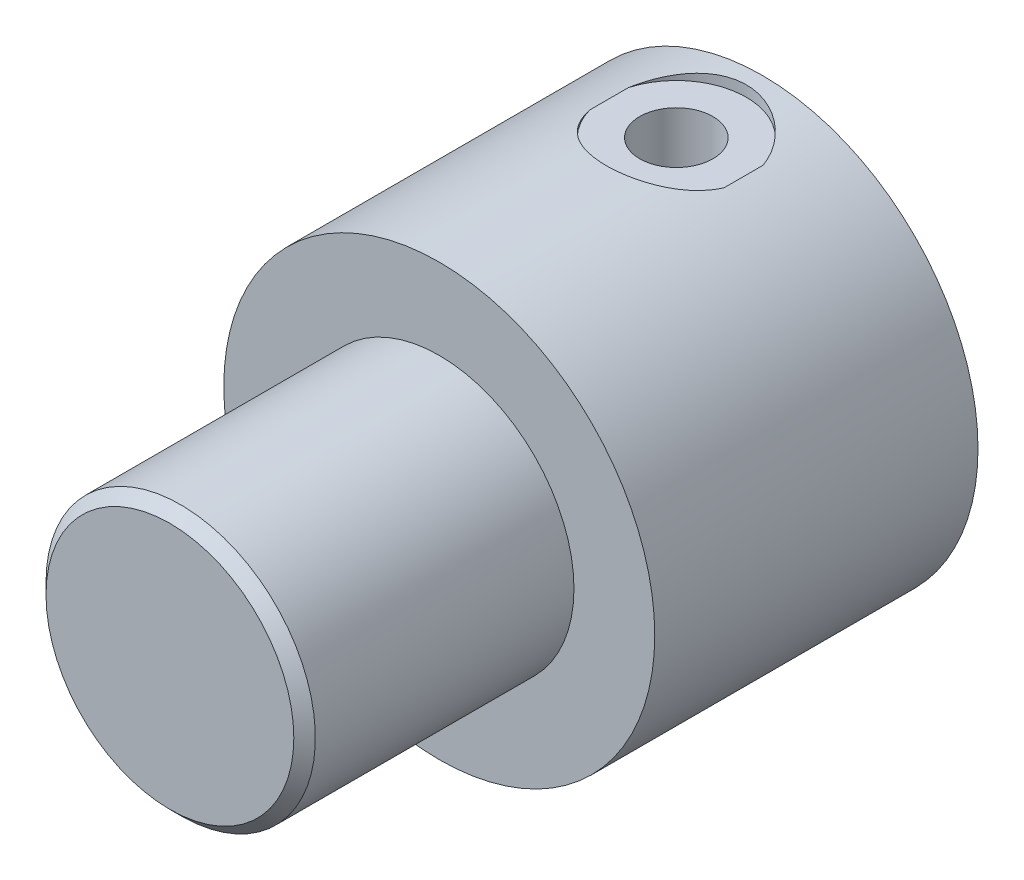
ISO-10303-21;
HEADER;
FILE_DESCRIPTION(('STEP AP214'),'2;1');
FILE_NAME('part.step','',(''),(''),'','','');
FILE_SCHEMA(('AUTOMOTIVE_DESIGN { 1 0 10303 214 1 1 1 1 }'));
ENDSEC;
DATA;
#1=APPLICATION_CONTEXT('core data for automotive mechanical design processes');
#2=APPLICATION_PROTOCOL_DEFINITION('international standard','automotive_design',2000,#1);
#3=PRODUCT_CONTEXT('',#1,'mechanical');
#4=PRODUCT('Part','Part','',(#3));
#5=PRODUCT_RELATED_PRODUCT_CATEGORY('part','',(#4));
#6=PRODUCT_DEFINITION_FORMATION('','',#4);
#7=PRODUCT_DEFINITION_CONTEXT('part definition',#1,'design');
#8=PRODUCT_DEFINITION('design','',#6,#7);
#9=PRODUCT_DEFINITION_SHAPE('','',#8);
#10=(LENGTH_UNIT() NAMED_UNIT(*) SI_UNIT(.MILLI.,.METRE.));
#11=(NAMED_UNIT(*) PLANE_ANGLE_UNIT() SI_UNIT($,.RADIAN.));
#12=(NAMED_UNIT(*) SI_UNIT($,.STERADIAN.) SOLID_ANGLE_UNIT());
#13=UNCERTAINTY_MEASURE_WITH_UNIT(LENGTH_MEASURE(1.E-05),#10,'distance_accuracy_value','');
#14=(GEOMETRIC_REPRESENTATION_CONTEXT(3) GLOBAL_UNCERTAINTY_ASSIGNED_CONTEXT((#13)) GLOBAL_UNIT_ASSIGNED_CONTEXT((#10,
#11,#12)) REPRESENTATION_CONTEXT('',''));
#15=CARTESIAN_POINT('',(0.,0.,0.));
#16=DIRECTION('',(0.,0.,1.));
#17=DIRECTION('',(1.,0.,0.));
#18=AXIS2_PLACEMENT_3D('',#15,#16,#17);
#19=CARTESIAN_POINT('',(0.,0.,30.));
#20=DIRECTION('',(0.,0.,-1.));
#21=DIRECTION('',(-1.,0.,0.));
#22=AXIS2_PLACEMENT_3D('',#19,#20,#21);
#23=CYLINDRICAL_SURFACE('',#22,20.);
#24=CARTESIAN_POINT('',(0.,0.,30.));
#25=DIRECTION('',(0.,0.,1.));
#26=DIRECTION('',(1.,0.,0.));
#27=AXIS2_PLACEMENT_3D('',#24,#25,#26);
#28=CIRCLE('',#27,20.);
#29=CARTESIAN_POINT('',(20.,0.,30.));
#30=VERTEX_POINT('',#29);
#31=EDGE_CURVE('E399',#30,#30,#28,.T.);
#32=ORIENTED_EDGE('',*,*,#31,.F.);
#33=EDGE_LOOP('',(#32));
#34=FACE_BOUND('',#33,.T.);
#35=CARTESIAN_POINT('',(0.,0.,0.));
#36=DIRECTION('',(0.,0.,1.));
#37=DIRECTION('',(1.,0.,0.));
#38=AXIS2_PLACEMENT_3D('',#35,#36,#37);
#39=CIRCLE('',#38,20.);
#40=CARTESIAN_POINT('',(20.,0.,0.));
#41=VERTEX_POINT('',#40);
#42=EDGE_CURVE('E396',#41,#41,#39,.T.);
#43=ORIENTED_EDGE('',*,*,#42,.T.);
#44=EDGE_LOOP('',(#43));
#45=FACE_BOUND('',#44,.T.);
#46=DIRECTION('',(0.,0.,-1.));
#47=VECTOR('',#46,1.);
#48=CARTESIAN_POINT('',(6.24499799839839,19.,30.));
#49=LINE('',#48,#47);
#50=CARTESIAN_POINT('',(6.24499799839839,19.,9.80277563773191));
#51=VERTEX_POINT('',#50);
#52=CARTESIAN_POINT('',(6.24499799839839,19.,6.19722436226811));
#53=VERTEX_POINT('',#52);
#54=EDGE_CURVE('E444',#51,#53,#49,.T.);
#55=ORIENTED_EDGE('',*,*,#54,.F.);
#56=CARTESIAN_POINT('',(-6.24499799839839,19.,9.80277563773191));
#57=CARTESIAN_POINT('',(-6.19409175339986,19.0167193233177,9.97918899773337));
#58=CARTESIAN_POINT('',(-6.13573893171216,19.0356851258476,10.1532131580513));
#59=CARTESIAN_POINT('',(-6.00475499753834,19.0774150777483,10.4952712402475));
#60=CARTESIAN_POINT('',(-5.93212844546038,19.1001780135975,10.6633070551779));
#61=CARTESIAN_POINT('',(-5.77330213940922,19.1487813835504,10.9920350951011));
#62=CARTESIAN_POINT('',(-5.68712364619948,19.1746169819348,11.1527383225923));
#63=CARTESIAN_POINT('',(-5.50177391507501,19.2286194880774,11.4660660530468));
#64=CARTESIAN_POINT('',(-5.40260182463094,19.2567865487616,11.6186900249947));
#65=CARTESIAN_POINT('',(-5.19206969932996,19.3146139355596,11.9147643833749));
#66=CARTESIAN_POINT('',(-5.08072097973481,19.3442728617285,12.0582230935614));
#67=CARTESIAN_POINT('',(-4.84645582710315,19.4042904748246,12.3352958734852));
#68=CARTESIAN_POINT('',(-4.7235351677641,19.4346494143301,12.4689063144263));
#69=CARTESIAN_POINT('',(-4.46694304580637,19.4952248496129,12.7253913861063));
#70=CARTESIAN_POINT('',(-4.33327219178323,19.5254413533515,12.8482666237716));
#71=CARTESIAN_POINT('',(-4.05594823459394,19.5849278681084,13.082543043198));
#72=CARTESIAN_POINT('',(-3.91229168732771,19.6141975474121,13.193940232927));
#73=CARTESIAN_POINT('',(-3.61297921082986,19.671554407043,13.4065461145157));
#74=CARTESIAN_POINT('',(-3.45714189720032,19.6996066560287,13.5075091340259));
#75=CARTESIAN_POINT('',(-3.13706684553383,19.7531044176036,13.695901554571));
#76=CARTESIAN_POINT('',(-2.97282934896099,19.7785500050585,13.7833313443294));
#77=CARTESIAN_POINT('',(-2.63705466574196,19.8261113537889,13.9439531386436));
#78=CARTESIAN_POINT('',(-2.46551711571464,19.8482269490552,14.0171444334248));
#79=CARTESIAN_POINT('',(-2.11644237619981,19.8884770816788,14.1486127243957));
#80=CARTESIAN_POINT('',(-1.9389077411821,19.9066132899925,14.2068959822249));
#81=CARTESIAN_POINT('',(-1.58429351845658,19.9379230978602,14.3065800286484));
#82=CARTESIAN_POINT('',(-1.40734844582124,19.9512247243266,14.3484191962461));
#83=CARTESIAN_POINT('',(-1.05036510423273,19.9731994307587,14.4171455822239));
#84=CARTESIAN_POINT('',(-0.870328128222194,19.9818743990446,14.4440389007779));
#85=CARTESIAN_POINT('',(-0.508475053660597,19.9943548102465,14.4826351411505));
#86=CARTESIAN_POINT('',(-0.326659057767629,19.9981605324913,14.4943389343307));
#87=CARTESIAN_POINT('',(0.0373476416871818,20.0007931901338,14.5024413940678));
#88=CARTESIAN_POINT('',(0.219538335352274,19.9996202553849,14.4988404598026));
#89=CARTESIAN_POINT('',(0.575566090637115,19.9924772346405,14.4768237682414));
#90=CARTESIAN_POINT('',(0.749444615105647,19.986701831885,14.4590092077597));
#91=CARTESIAN_POINT('',(1.09506419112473,19.9707478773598,14.4094711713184));
#92=CARTESIAN_POINT('',(1.26680449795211,19.960567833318,14.3777429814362));
#93=CARTESIAN_POINT('',(1.60683520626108,19.9360760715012,14.3006715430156));
#94=CARTESIAN_POINT('',(1.7751267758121,19.9217657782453,14.2553329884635));
#95=CARTESIAN_POINT('',(2.10725966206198,19.8893768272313,14.1514020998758));
#96=CARTESIAN_POINT('',(2.2710992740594,19.8712967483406,14.0928047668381));
#97=CARTESIAN_POINT('',(2.59441141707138,19.8316855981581,13.9623521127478));
#98=CARTESIAN_POINT('',(2.75384246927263,19.8101298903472,13.8904015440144));
#99=CARTESIAN_POINT('',(3.06612613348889,19.7642047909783,13.7340539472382));
#100=CARTESIAN_POINT('',(3.21897632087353,19.7398343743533,13.6496523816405));
#101=CARTESIAN_POINT('',(3.51712665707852,19.688897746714,13.4690218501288));
#102=CARTESIAN_POINT('',(3.66242699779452,19.6623315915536,13.3727931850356));
#103=CARTESIAN_POINT('',(3.94469941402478,19.6076522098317,13.1691054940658));
#104=CARTESIAN_POINT('',(4.08166838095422,19.5795384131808,13.061642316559));
#105=CARTESIAN_POINT('',(4.35233701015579,19.5211980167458,12.8311637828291));
#106=CARTESIAN_POINT('',(4.48562099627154,19.4909330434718,12.7076695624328));
#107=CARTESIAN_POINT('',(4.74142831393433,19.4302894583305,12.4499262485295));
#108=CARTESIAN_POINT('',(4.86394717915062,19.3999108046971,12.3156727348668));
#109=CARTESIAN_POINT('',(5.09728484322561,19.3399118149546,12.0374019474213));
#110=CARTESIAN_POINT('',(5.20811440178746,19.3102908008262,11.8933938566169));
#111=CARTESIAN_POINT('',(5.41746994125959,19.2526053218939,11.5963963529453));
#112=CARTESIAN_POINT('',(5.51599334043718,19.2245411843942,11.4434050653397));
#113=CARTESIAN_POINT('',(5.74398657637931,19.1579414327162,11.0543117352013));
#114=CARTESIAN_POINT('',(5.86579519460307,19.1207978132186,10.8133815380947));
#115=CARTESIAN_POINT('',(6.02550700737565,19.0708250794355,10.441618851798));
#116=CARTESIAN_POINT('',(6.07491048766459,19.0551247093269,10.3159709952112));
#117=CARTESIAN_POINT('',(6.16588265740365,19.0258808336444,10.061583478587));
#118=CARTESIAN_POINT('',(6.2074490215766,19.0123379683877,9.93284291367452));
#119=CARTESIAN_POINT('',(6.24499799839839,19.,9.80277563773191));
#120=B_SPLINE_CURVE_WITH_KNOTS('',3,(#56,#57,#58,#59,#60,#61,#62,#63,#64,#65,#66,#67,#68,#69,
#70,#71,#72,#73,#74,#75,#76,#77,#78,#79,#80,#81,#82,#83,#84,#85,#86,#87,#88,#89,#90,#91,#92,#93,
#94,#95,#96,#97,#98,#99,#100,#101,#102,#103,#104,#105,#106,#107,#108,#109,#110,#111,#112,#113,
#114,#115,#116,#117,#118,#119),.UNSPECIFIED.,.F.,.F.,(4,2,2,2,2,2,2,2,2,2,2,2,2,2,2,2,2,2,2,2,2,
2,2,2,2,2,2,2,2,2,2,4),(0.,0.552897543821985,1.10561872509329,1.6574812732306,2.20938004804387,
2.7607702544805,3.31236262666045,3.86392379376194,4.41567614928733,4.97836332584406,
5.54103433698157,6.10373338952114,6.66619570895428,7.21243805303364,7.75845728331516,
8.30444518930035,8.85041885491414,9.37445082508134,9.89866047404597,10.4226895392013,
10.9469165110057,11.4750374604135,12.0033513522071,12.5316518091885,13.0601481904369,
13.6121270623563,14.164333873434,14.7160278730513,15.2678374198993,16.0829103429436,
16.490440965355,16.89809231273),.UNSPECIFIED.);
#121=CARTESIAN_POINT('',(-6.24499799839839,19.,9.80277563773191));
#122=VERTEX_POINT('',#121);
#123=EDGE_CURVE('E403',#122,#51,#120,.T.);
#124=ORIENTED_EDGE('',*,*,#123,.F.);
#125=DIRECTION('',(0.,0.,-1.));
#126=VECTOR('',#125,1.);
#127=CARTESIAN_POINT('',(-6.24499799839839,19.,30.));
#128=LINE('',#127,#126);
#129=CARTESIAN_POINT('',(-6.24499799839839,19.,6.19722436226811));
#130=VERTEX_POINT('',#129);
#131=EDGE_CURVE('E368',#130,#122,#128,.F.);
#132=ORIENTED_EDGE('',*,*,#131,.F.);
#133=CARTESIAN_POINT('',(6.24499799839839,19.,6.19722436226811));
#134=CARTESIAN_POINT('',(6.1940900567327,19.0167198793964,6.02080511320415));
#135=CARTESIAN_POINT('',(6.13573503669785,19.0356863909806,5.84677522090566));
#136=CARTESIAN_POINT('',(6.00474574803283,19.0774179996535,5.50470605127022));
#137=CARTESIAN_POINT('',(5.93211603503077,19.100181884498,5.33666488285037));
#138=CARTESIAN_POINT('',(5.77328785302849,19.1487856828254,5.00793770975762));
#139=CARTESIAN_POINT('',(5.68711156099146,19.1746205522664,4.84724022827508));
#140=CARTESIAN_POINT('',(5.50176718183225,19.2286214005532,4.53392358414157));
#141=CARTESIAN_POINT('',(5.40259825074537,19.2567875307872,4.38130494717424));
#142=CARTESIAN_POINT('',(5.19207631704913,19.314612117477,4.08524492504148));
#143=CARTESIAN_POINT('',(5.08073498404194,19.3442691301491,3.94179495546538));
#144=CARTESIAN_POINT('',(4.8464886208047,19.4042822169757,3.66474142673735));
#145=CARTESIAN_POINT('',(4.72357961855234,19.4346385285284,3.53114127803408));
#146=CARTESIAN_POINT('',(4.46696940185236,19.4952190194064,3.27463179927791));
#147=CARTESIAN_POINT('',(4.33326518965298,19.5254431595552,3.1517254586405));
#148=CARTESIAN_POINT('',(4.05591880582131,19.5849338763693,2.9174340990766));
#149=CARTESIAN_POINT('',(3.91227669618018,19.614200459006,2.80604900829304));
#150=CARTESIAN_POINT('',(3.61290423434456,19.6715687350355,2.59340074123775));
#151=CARTESIAN_POINT('',(3.45698688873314,19.6996344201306,2.49239080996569));
#152=CARTESIAN_POINT('',(3.13680015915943,19.7531471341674,2.30395030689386));
#153=CARTESIAN_POINT('',(2.97253383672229,19.7785951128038,2.21651480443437));
#154=CARTESIAN_POINT('',(2.63679293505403,19.8261451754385,2.05593416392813));
#155=CARTESIAN_POINT('',(2.46532242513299,19.8482491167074,1.98278108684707));
#156=CARTESIAN_POINT('',(2.11637900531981,19.8884846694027,1.85136456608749));
#157=CARTESIAN_POINT('',(1.93890717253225,19.9066169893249,1.79309846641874));
#158=CARTESIAN_POINT('',(1.47396044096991,19.9476589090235,1.6624132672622));
#159=CARTESIAN_POINT('',(1.18281698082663,19.9671666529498,1.60162596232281));
#160=CARTESIAN_POINT('',(0.594393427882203,19.9933328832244,1.52042687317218));
#161=CARTESIAN_POINT('',(0.297114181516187,19.9999931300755,1.50000955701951));
#162=CARTESIAN_POINT('',(-0.177565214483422,20.000004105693,1.49999428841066));
#163=CARTESIAN_POINT('',(-0.355071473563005,19.9976318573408,1.50727751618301));
#164=CARTESIAN_POINT('',(-0.708820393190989,19.9882173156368,1.53632892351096));
#165=CARTESIAN_POINT('',(-0.885062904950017,19.9811744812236,1.55809878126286));
#166=CARTESIAN_POINT('',(-1.23499698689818,19.9626028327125,1.61593747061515));
#167=CARTESIAN_POINT('',(-1.40868765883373,19.9510724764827,1.65201121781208));
#168=CARTESIAN_POINT('',(-1.75229852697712,19.9238339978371,1.73814475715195));
#169=CARTESIAN_POINT('',(-1.9222172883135,19.9081243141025,1.78820977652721));
#170=CARTESIAN_POINT('',(-2.25668014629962,19.8729869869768,1.90176112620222));
#171=CARTESIAN_POINT('',(-2.42123540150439,19.8535677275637,1.96521722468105));
#172=CARTESIAN_POINT('',(-2.74435799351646,19.8114879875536,2.10512876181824));
#173=CARTESIAN_POINT('',(-2.90292321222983,19.7888263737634,2.18158874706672));
#174=CARTESIAN_POINT('',(-3.21300945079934,19.7408506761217,2.3469088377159));
#175=CARTESIAN_POINT('',(-3.36453108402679,19.7155368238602,2.4357678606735));
#176=CARTESIAN_POINT('',(-3.65964980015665,19.6628948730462,2.6252704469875));
#177=CARTESIAN_POINT('',(-3.80324658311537,19.635566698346,2.72591445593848));
#178=CARTESIAN_POINT('',(-4.08590148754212,19.5787337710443,2.9415461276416));
#179=CARTESIAN_POINT('',(-4.22469055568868,19.5491881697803,3.0568758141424));
#180=CARTESIAN_POINT('',(-4.49209054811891,19.489481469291,3.29855435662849));
#181=CARTESIAN_POINT('',(-4.62070463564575,19.4593205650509,3.42489976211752));
#182=CARTESIAN_POINT('',(-4.86703051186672,19.399177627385,3.6878688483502));
#183=CARTESIAN_POINT('',(-4.98474120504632,19.3691956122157,3.82449355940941));
#184=CARTESIAN_POINT('',(-5.20845794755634,19.310239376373,4.10713045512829));
#185=CARTESIAN_POINT('',(-5.31446871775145,19.2812647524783,4.25313881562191));
#186=CARTESIAN_POINT('',(-5.50543153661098,19.2275633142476,4.54061356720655));
#187=CARTESIAN_POINT('',(-5.5914134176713,19.202686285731,4.68136901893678));
#188=CARTESIAN_POINT('',(-5.75255453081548,19.1550299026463,4.96926950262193));
#189=CARTESIAN_POINT('',(-5.82771504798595,19.1322502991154,5.11641377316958));
#190=CARTESIAN_POINT('',(-5.96678522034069,19.0893373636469,5.41643309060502));
#191=CARTESIAN_POINT('',(-6.03068685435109,19.0692059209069,5.56931212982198));
#192=CARTESIAN_POINT('',(-6.14675890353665,19.0321039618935,5.87988411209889));
#193=CARTESIAN_POINT('',(-6.19892573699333,19.0151344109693,6.03757850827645));
#194=CARTESIAN_POINT('',(-6.24499799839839,19.,6.19722436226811));
#195=B_SPLINE_CURVE_WITH_KNOTS('',3,(#133,#134,#135,#136,#137,#138,#139,#140,#141,#142,#143,
#144,#145,#146,#147,#148,#149,#150,#151,#152,#153,#154,#155,#156,#157,#158,#159,#160,#161,#162,
#163,#164,#165,#166,#167,#168,#169,#170,#171,#172,#173,#174,#175,#176,#177,#178,#179,#180,#181,
#182,#183,#184,#185,#186,#187,#188,#189,#190,#191,#192,#193,#194),.UNSPECIFIED.,.F.,.F.,(4,2,2,
2,2,2,2,2,2,2,2,2,2,2,2,2,2,2,2,2,2,2,2,2,2,2,2,2,2,2,4),(0.,0.552915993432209,1.10565581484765,
1.65749999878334,2.20938004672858,2.76073557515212,3.31228111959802,3.86398035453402,
4.41567614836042,4.97864172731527,5.54140233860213,6.10384923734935,6.6661957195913,
7.55721473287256,8.44811164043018,8.98054095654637,9.51303196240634,10.0457061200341,
10.5785795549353,11.1102625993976,11.6421319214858,12.1739548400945,12.7057978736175,
13.2537435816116,13.8015182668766,14.3493479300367,14.896955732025,15.3968966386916,
15.8967781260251,16.397014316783,16.8974029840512),.UNSPECIFIED.);
#196=EDGE_CURVE('E409',#53,#130,#195,.T.);
#197=ORIENTED_EDGE('',*,*,#196,.F.);
#198=EDGE_LOOP('',(#55,#124,#132,#197));
#199=FACE_BOUND('',#198,.T.);
#200=ADVANCED_FACE('F348',(#34,#45,#199),#23,.T.);
#201=CARTESIAN_POINT('',(0.,0.,30.));
#202=DIRECTION('',(0.,0.,1.));
#203=DIRECTION('',(1.,0.,0.));
#204=AXIS2_PLACEMENT_3D('',#201,#202,#203);
#205=PLANE('',#204);
#206=CARTESIAN_POINT('',(0.,0.,30.));
#207=DIRECTION('',(0.,0.,1.));
#208=DIRECTION('',(1.,0.,0.));
#209=AXIS2_PLACEMENT_3D('',#206,#207,#208);
#210=CIRCLE('',#209,12.5);
#211=CARTESIAN_POINT('',(12.5,0.,30.));
#212=VERTEX_POINT('',#211);
#213=EDGE_CURVE('E437',#212,#212,#210,.T.);
#214=ORIENTED_EDGE('',*,*,#213,.F.);
#215=EDGE_LOOP('',(#214));
#216=FACE_BOUND('',#215,.T.);
#217=ORIENTED_EDGE('',*,*,#31,.T.);
#218=EDGE_LOOP('',(#217));
#219=FACE_BOUND('',#218,.T.);
#220=ADVANCED_FACE('F426',(#216,#219),#205,.T.);
#221=CARTESIAN_POINT('',(0.,0.,0.));
#222=DIRECTION('',(0.,0.,1.));
#223=DIRECTION('',(1.,0.,0.));
#224=AXIS2_PLACEMENT_3D('',#221,#222,#223);
#225=PLANE('',#224);
#226=ORIENTED_EDGE('',*,*,#42,.F.);
#227=EDGE_LOOP('',(#226));
#228=FACE_BOUND('',#227,.T.);
#229=ADVANCED_FACE('F420',(#228),#225,.F.);
#230=CARTESIAN_POINT('',(0.,20.,8.00000000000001));
#231=DIRECTION('',(0.,-1.,0.));
#232=DIRECTION('',(0.,0.,-1.));
#233=AXIS2_PLACEMENT_3D('',#230,#231,#232);
#234=CYLINDRICAL_SURFACE('',#233,6.5);
#235=ORIENTED_EDGE('',*,*,#123,.T.);
#236=CARTESIAN_POINT('',(0.,19.,8.00000000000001));
#237=DIRECTION('',(0.,1.,0.));
#238=DIRECTION('',(0.,0.,1.));
#239=AXIS2_PLACEMENT_3D('',#236,#237,#238);
#240=CIRCLE('',#239,6.5);
#241=EDGE_CURVE('E392',#122,#51,#240,.T.);
#242=ORIENTED_EDGE('',*,*,#241,.F.);
#243=EDGE_LOOP('',(#235,#242));
#244=FACE_BOUND('',#243,.T.);
#245=ADVANCED_FACE('F414',(#244),#234,.F.);
#246=ORIENTED_EDGE('',*,*,#196,.T.);
#247=EDGE_CURVE('E363',#53,#130,#240,.T.);
#248=ORIENTED_EDGE('',*,*,#247,.F.);
#249=EDGE_LOOP('',(#246,#248));
#250=FACE_BOUND('',#249,.T.);
#251=ADVANCED_FACE('F419',(#250),#234,.F.);
#252=CARTESIAN_POINT('',(0.,19.,8.00000000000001));
#253=DIRECTION('',(0.,1.,0.));
#254=DIRECTION('',(0.,0.,1.));
#255=AXIS2_PLACEMENT_3D('',#252,#253,#254);
#256=PLANE('',#255);
#257=CARTESIAN_POINT('',(0.,19.,8.00000000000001));
#258=DIRECTION('',(0.,1.,0.));
#259=DIRECTION('',(0.,0.,1.));
#260=AXIS2_PLACEMENT_3D('',#257,#258,#259);
#261=CIRCLE('',#260,3.39999999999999);
#262=CARTESIAN_POINT('',(0.,19.,11.4));
#263=VERTEX_POINT('',#262);
#264=EDGE_CURVE('E389',#263,#263,#261,.T.);
#265=ORIENTED_EDGE('',*,*,#264,.F.);
#266=EDGE_LOOP('',(#265));
#267=FACE_BOUND('',#266,.T.);
#268=ORIENTED_EDGE('',*,*,#54,.T.);
#269=ORIENTED_EDGE('',*,*,#247,.T.);
#270=ORIENTED_EDGE('',*,*,#131,.T.);
#271=ORIENTED_EDGE('',*,*,#241,.T.);
#272=EDGE_LOOP('',(#268,#269,#270,#271));
#273=FACE_BOUND('',#272,.T.);
#274=ADVANCED_FACE('F422',(#267,#273),#256,.T.);
#275=CARTESIAN_POINT('',(0.,19.,8.00000000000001));
#276=DIRECTION('',(0.,1.,0.));
#277=DIRECTION('',(0.,0.,1.));
#278=AXIS2_PLACEMENT_3D('',#275,#276,#277);
#279=CYLINDRICAL_SURFACE('',#278,3.39999999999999);
#280=CARTESIAN_POINT('',(0.,-3.24999999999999,8.00000000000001));
#281=DIRECTION('',(0.,1.,0.));
#282=DIRECTION('',(0.,0.,1.));
#283=AXIS2_PLACEMENT_3D('',#280,#281,#282);
#284=CIRCLE('',#283,3.39999999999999);
#285=CARTESIAN_POINT('',(0.,-3.24999999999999,11.4));
#286=VERTEX_POINT('',#285);
#287=EDGE_CURVE('E387',#286,#286,#284,.T.);
#288=ORIENTED_EDGE('',*,*,#287,.F.);
#289=EDGE_LOOP('',(#288));
#290=FACE_BOUND('',#289,.T.);
#291=ORIENTED_EDGE('',*,*,#264,.T.);
#292=EDGE_LOOP('',(#291));
#293=FACE_BOUND('',#292,.T.);
#294=ADVANCED_FACE('F383',(#290,#293),#279,.F.);
#295=CARTESIAN_POINT('',(0.,-3.24999999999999,8.00000000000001));
#296=DIRECTION('',(0.,1.,0.));
#297=DIRECTION('',(0.,0.,1.));
#298=AXIS2_PLACEMENT_3D('',#295,#296,#297);
#299=CONICAL_SURFACE('',#298,3.39999999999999,1.02974425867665);
#300=CARTESIAN_POINT('',(0.,-5.29292610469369,8.00000000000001));
#301=VERTEX_POINT('',#300);
#302=VERTEX_LOOP('',#301);
#303=FACE_BOUND('',#302,.T.);
#304=ORIENTED_EDGE('',*,*,#287,.T.);
#305=EDGE_LOOP('',(#304));
#306=FACE_BOUND('',#305,.T.);
#307=ADVANCED_FACE('F379',(#303,#306),#299,.F.);
#308=CARTESIAN_POINT('',(0.,0.,54.9999999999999));
#309=DIRECTION('',(0.,0.,-1.));
#310=DIRECTION('',(-1.,0.,0.));
#311=AXIS2_PLACEMENT_3D('',#308,#309,#310);
#312=CYLINDRICAL_SURFACE('',#311,12.5);
#313=CARTESIAN_POINT('',(0.,0.,54.));
#314=DIRECTION('',(0.,0.,-1.));
#315=DIRECTION('',(-1.,0.,0.));
#316=AXIS2_PLACEMENT_3D('',#313,#314,#315);
#317=CIRCLE('',#316,12.5);
#318=CARTESIAN_POINT('',(-12.5,0.,54.));
#319=VERTEX_POINT('',#318);
#320=EDGE_CURVE('E356',#319,#319,#317,.T.);
#321=ORIENTED_EDGE('',*,*,#320,.T.);
#322=EDGE_LOOP('',(#321));
#323=FACE_BOUND('',#322,.T.);
#324=ORIENTED_EDGE('',*,*,#213,.T.);
#325=EDGE_LOOP('',(#324));
#326=FACE_BOUND('',#325,.T.);
#327=ADVANCED_FACE('F382',(#323,#326),#312,.T.);
#328=CARTESIAN_POINT('',(0.,0.,54.9999999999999));
#329=DIRECTION('',(0.,0.,-1.));
#330=DIRECTION('',(-1.,0.,0.));
#331=AXIS2_PLACEMENT_3D('',#328,#329,#330);
#332=PLANE('',#331);
#333=CARTESIAN_POINT('',(0.,0.,54.9999999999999));
#334=DIRECTION('',(0.,0.,-1.));
#335=DIRECTION('',(-1.,0.,0.));
#336=AXIS2_PLACEMENT_3D('',#333,#334,#335);
#337=CIRCLE('',#336,11.5);
#338=CARTESIAN_POINT('',(-11.5,0.,54.9999999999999));
#339=VERTEX_POINT('',#338);
#340=EDGE_CURVE('E11',#339,#339,#337,.F.);
#341=ORIENTED_EDGE('',*,*,#340,.T.);
#342=EDGE_LOOP('',(#341));
#343=FACE_BOUND('',#342,.T.);
#344=ADVANCED_FACE('F453',(#343),#332,.F.);
#345=CARTESIAN_POINT('',(0.,0.,54.));
#346=DIRECTION('',(0.,0.,-1.));
#347=DIRECTION('',(-1.,0.,0.));
#348=AXIS2_PLACEMENT_3D('',#345,#346,#347);
#349=CONICAL_SURFACE('',#348,12.5,0.785398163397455);
#350=ORIENTED_EDGE('',*,*,#340,.F.);
#351=EDGE_LOOP('',(#350));
#352=FACE_BOUND('',#351,.T.);
#353=ORIENTED_EDGE('',*,*,#320,.F.);
#354=EDGE_LOOP('',(#353));
#355=FACE_BOUND('',#354,.T.);
#356=ADVANCED_FACE('F451',(#352,#355),#349,.T.);
#357=CLOSED_SHELL('',(#200,#220,#229,#245,#251,#274,#294,#307,#327,#344,#356));
#358=MANIFOLD_SOLID_BREP('B2',#357);
#359=ADVANCED_BREP_SHAPE_REPRESENTATION('',(#18,#358),#14);
#360=SHAPE_DEFINITION_REPRESENTATION(#9,#359);
ENDSEC;
END-ISO-10303-21;
